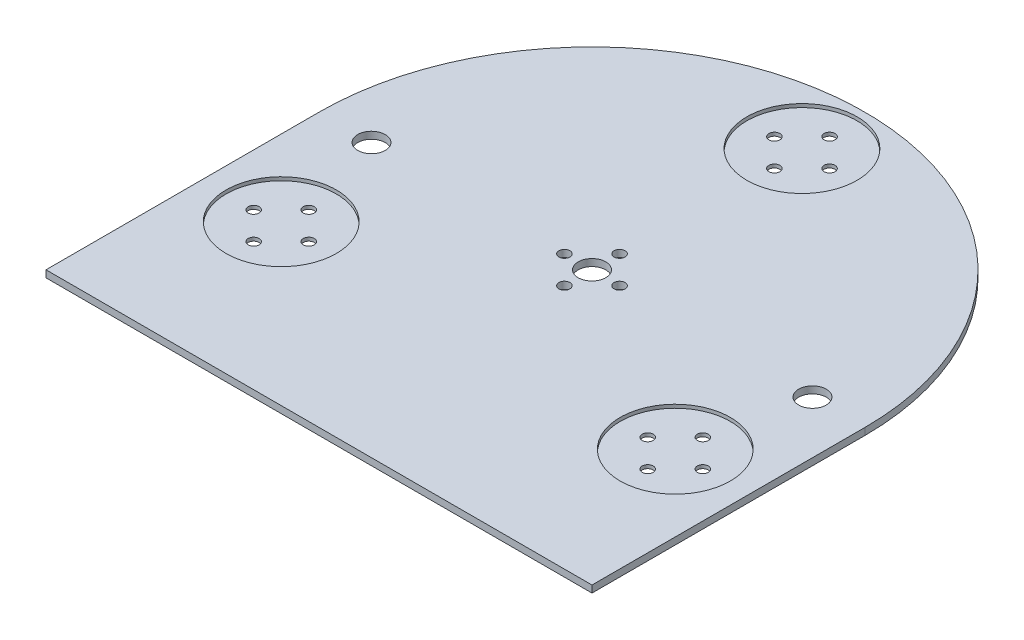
ISO-10303-21;
HEADER;
FILE_DESCRIPTION(('STEP AP214'),'2;1');
FILE_NAME('part.step','',(''),(''),'','','');
FILE_SCHEMA(('AUTOMOTIVE_DESIGN { 1 0 10303 214 1 1 1 1 }'));
ENDSEC;
DATA;
#1=APPLICATION_CONTEXT('core data for automotive mechanical design processes');
#2=APPLICATION_PROTOCOL_DEFINITION('international standard','automotive_design',2000,#1);
#3=PRODUCT_CONTEXT('',#1,'mechanical');
#4=PRODUCT('Part','Part','',(#3));
#5=PRODUCT_RELATED_PRODUCT_CATEGORY('part','',(#4));
#6=PRODUCT_DEFINITION_FORMATION('','',#4);
#7=PRODUCT_DEFINITION_CONTEXT('part definition',#1,'design');
#8=PRODUCT_DEFINITION('design','',#6,#7);
#9=PRODUCT_DEFINITION_SHAPE('','',#8);
#10=(LENGTH_UNIT() NAMED_UNIT(*) SI_UNIT(.MILLI.,.METRE.));
#11=(NAMED_UNIT(*) PLANE_ANGLE_UNIT() SI_UNIT($,.RADIAN.));
#12=(NAMED_UNIT(*) SI_UNIT($,.STERADIAN.) SOLID_ANGLE_UNIT());
#13=UNCERTAINTY_MEASURE_WITH_UNIT(LENGTH_MEASURE(1.E-05),#10,'distance_accuracy_value','');
#14=(GEOMETRIC_REPRESENTATION_CONTEXT(3) GLOBAL_UNCERTAINTY_ASSIGNED_CONTEXT((#13)) GLOBAL_UNIT_ASSIGNED_CONTEXT((#10,
#11,#12)) REPRESENTATION_CONTEXT('',''));
#15=CARTESIAN_POINT('',(0.,0.,0.));
#16=DIRECTION('',(0.,0.,1.));
#17=DIRECTION('',(1.,0.,0.));
#18=AXIS2_PLACEMENT_3D('',#15,#16,#17);
#19=CARTESIAN_POINT('',(0.,2.54,0.));
#20=DIRECTION('',(0.,-1.,0.));
#21=DIRECTION('',(0.,0.,-1.));
#22=AXIS2_PLACEMENT_3D('',#19,#20,#21);
#23=CYLINDRICAL_SURFACE('',#22,99.06);
#24=CARTESIAN_POINT('',(0.,0.,0.));
#25=DIRECTION('',(0.,1.,0.));
#26=DIRECTION('',(0.,0.,1.));
#27=AXIS2_PLACEMENT_3D('',#24,#25,#26);
#28=CIRCLE('',#27,99.06);
#29=CARTESIAN_POINT('',(99.06,0.,0.));
#30=VERTEX_POINT('',#29);
#31=CARTESIAN_POINT('',(-99.06,0.,0.));
#32=VERTEX_POINT('',#31);
#33=EDGE_CURVE('E122',#30,#32,#28,.T.);
#34=ORIENTED_EDGE('',*,*,#33,.T.);
#35=DIRECTION('',(0.,-1.,0.));
#36=VECTOR('',#35,1.);
#37=CARTESIAN_POINT('',(-99.06,2.54,0.));
#38=LINE('',#37,#36);
#39=CARTESIAN_POINT('',(-99.06,2.54,0.));
#40=VERTEX_POINT('',#39);
#41=EDGE_CURVE('E11',#40,#32,#38,.T.);
#42=ORIENTED_EDGE('',*,*,#41,.F.);
#43=CARTESIAN_POINT('',(0.,2.54,0.));
#44=DIRECTION('',(0.,1.,0.));
#45=DIRECTION('',(0.,0.,1.));
#46=AXIS2_PLACEMENT_3D('',#43,#44,#45);
#47=CIRCLE('',#46,99.06);
#48=CARTESIAN_POINT('',(99.06,2.54,0.));
#49=VERTEX_POINT('',#48);
#50=EDGE_CURVE('E103',#49,#40,#47,.T.);
#51=ORIENTED_EDGE('',*,*,#50,.F.);
#52=DIRECTION('',(0.,-1.,0.));
#53=VECTOR('',#52,1.);
#54=CARTESIAN_POINT('',(99.06,2.54,0.));
#55=LINE('',#54,#53);
#56=EDGE_CURVE('E70',#49,#30,#55,.T.);
#57=ORIENTED_EDGE('',*,*,#56,.T.);
#58=EDGE_LOOP('',(#34,#42,#51,#57));
#59=FACE_BOUND('',#58,.T.);
#60=ADVANCED_FACE('F51',(#59),#23,.T.);
#61=CARTESIAN_POINT('',(-99.06,2.54,0.));
#62=DIRECTION('',(1.,0.,0.));
#63=DIRECTION('',(0.,0.,-1.));
#64=AXIS2_PLACEMENT_3D('',#61,#62,#63);
#65=PLANE('',#64);
#66=DIRECTION('',(0.,0.,1.));
#67=VECTOR('',#66,1.);
#68=CARTESIAN_POINT('',(-99.06,0.,0.));
#69=LINE('',#68,#67);
#70=CARTESIAN_POINT('',(-99.06,0.,99.06));
#71=VERTEX_POINT('',#70);
#72=EDGE_CURVE('E109',#32,#71,#69,.T.);
#73=ORIENTED_EDGE('',*,*,#72,.T.);
#74=DIRECTION('',(0.,-1.,0.));
#75=VECTOR('',#74,1.);
#76=CARTESIAN_POINT('',(-99.06,2.54,99.06));
#77=LINE('',#76,#75);
#78=CARTESIAN_POINT('',(-99.06,2.54,99.06));
#79=VERTEX_POINT('',#78);
#80=EDGE_CURVE('E61',#79,#71,#77,.T.);
#81=ORIENTED_EDGE('',*,*,#80,.F.);
#82=DIRECTION('',(0.,0.,1.));
#83=VECTOR('',#82,1.);
#84=CARTESIAN_POINT('',(-99.06,2.54,0.));
#85=LINE('',#84,#83);
#86=EDGE_CURVE('E96',#40,#79,#85,.T.);
#87=ORIENTED_EDGE('',*,*,#86,.F.);
#88=ORIENTED_EDGE('',*,*,#41,.T.);
#89=EDGE_LOOP('',(#73,#81,#87,#88));
#90=FACE_BOUND('',#89,.T.);
#91=ADVANCED_FACE('F108',(#90),#65,.F.);
#92=CARTESIAN_POINT('',(0.,2.54,99.06));
#93=DIRECTION('',(0.,0.,-1.));
#94=DIRECTION('',(-1.,0.,0.));
#95=AXIS2_PLACEMENT_3D('',#92,#93,#94);
#96=PLANE('',#95);
#97=DIRECTION('',(1.,0.,0.));
#98=VECTOR('',#97,1.);
#99=CARTESIAN_POINT('',(0.,0.,99.06));
#100=LINE('',#99,#98);
#101=CARTESIAN_POINT('',(99.06,0.,99.06));
#102=VERTEX_POINT('',#101);
#103=EDGE_CURVE('E128',#71,#102,#100,.T.);
#104=ORIENTED_EDGE('',*,*,#103,.T.);
#105=DIRECTION('',(0.,-1.,0.));
#106=VECTOR('',#105,1.);
#107=CARTESIAN_POINT('',(99.06,2.54,99.06));
#108=LINE('',#107,#106);
#109=CARTESIAN_POINT('',(99.06,2.54,99.06));
#110=VERTEX_POINT('',#109);
#111=EDGE_CURVE('E85',#110,#102,#108,.T.);
#112=ORIENTED_EDGE('',*,*,#111,.F.);
#113=DIRECTION('',(1.,0.,0.));
#114=VECTOR('',#113,1.);
#115=CARTESIAN_POINT('',(0.,2.54,99.06));
#116=LINE('',#115,#114);
#117=EDGE_CURVE('E102',#79,#110,#116,.T.);
#118=ORIENTED_EDGE('',*,*,#117,.F.);
#119=ORIENTED_EDGE('',*,*,#80,.T.);
#120=EDGE_LOOP('',(#104,#112,#118,#119));
#121=FACE_BOUND('',#120,.T.);
#122=ADVANCED_FACE('F114',(#121),#96,.F.);
#123=CARTESIAN_POINT('',(99.06,2.54,0.));
#124=DIRECTION('',(1.,0.,0.));
#125=DIRECTION('',(0.,0.,-1.));
#126=AXIS2_PLACEMENT_3D('',#123,#124,#125);
#127=PLANE('',#126);
#128=DIRECTION('',(0.,0.,1.));
#129=VECTOR('',#128,1.);
#130=CARTESIAN_POINT('',(99.06,0.,0.));
#131=LINE('',#130,#129);
#132=EDGE_CURVE('E131',#30,#102,#131,.T.);
#133=ORIENTED_EDGE('',*,*,#132,.F.);
#134=ORIENTED_EDGE('',*,*,#56,.F.);
#135=DIRECTION('',(0.,0.,1.));
#136=VECTOR('',#135,1.);
#137=CARTESIAN_POINT('',(99.06,2.54,0.));
#138=LINE('',#137,#136);
#139=EDGE_CURVE('E116',#49,#110,#138,.T.);
#140=ORIENTED_EDGE('',*,*,#139,.T.);
#141=ORIENTED_EDGE('',*,*,#111,.T.);
#142=EDGE_LOOP('',(#133,#134,#140,#141));
#143=FACE_BOUND('',#142,.T.);
#144=ADVANCED_FACE('F230',(#143),#127,.T.);
#145=CARTESIAN_POINT('',(0.,2.54,0.));
#146=DIRECTION('',(0.,1.,0.));
#147=DIRECTION('',(0.,0.,1.));
#148=AXIS2_PLACEMENT_3D('',#145,#146,#147);
#149=PLANE('',#148);
#150=CARTESIAN_POINT('',(-10.,2.54,-1.04950770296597E-13));
#151=DIRECTION('',(0.,1.,0.));
#152=DIRECTION('',(0.,0.,1.));
#153=AXIS2_PLACEMENT_3D('',#150,#151,#152);
#154=CIRCLE('',#153,2.);
#155=CARTESIAN_POINT('',(-10.,2.54,1.99999999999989));
#156=VERTEX_POINT('',#155);
#157=EDGE_CURVE('E587',#156,#156,#154,.T.);
#158=ORIENTED_EDGE('',*,*,#157,.F.);
#159=EDGE_LOOP('',(#158));
#160=FACE_BOUND('',#159,.T.);
#161=CARTESIAN_POINT('',(0.,2.54,10.));
#162=DIRECTION('',(0.,1.,0.));
#163=DIRECTION('',(0.,0.,1.));
#164=AXIS2_PLACEMENT_3D('',#161,#162,#163);
#165=CIRCLE('',#164,2.);
#166=CARTESIAN_POINT('',(0.,2.54,12.));
#167=VERTEX_POINT('',#166);
#168=EDGE_CURVE('E594',#167,#167,#165,.T.);
#169=ORIENTED_EDGE('',*,*,#168,.F.);
#170=EDGE_LOOP('',(#169));
#171=FACE_BOUND('',#170,.T.);
#172=CARTESIAN_POINT('',(0.,2.54,-10.));
#173=DIRECTION('',(0.,1.,0.));
#174=DIRECTION('',(0.,0.,1.));
#175=AXIS2_PLACEMENT_3D('',#172,#173,#174);
#176=CIRCLE('',#175,2.);
#177=CARTESIAN_POINT('',(0.,2.54,-8.));
#178=VERTEX_POINT('',#177);
#179=EDGE_CURVE('E649',#178,#178,#176,.T.);
#180=ORIENTED_EDGE('',*,*,#179,.F.);
#181=EDGE_LOOP('',(#180));
#182=FACE_BOUND('',#181,.T.);
#183=CARTESIAN_POINT('',(10.,2.54,0.));
#184=DIRECTION('',(0.,1.,0.));
#185=DIRECTION('',(0.,0.,1.));
#186=AXIS2_PLACEMENT_3D('',#183,#184,#185);
#187=CIRCLE('',#186,2.);
#188=CARTESIAN_POINT('',(10.,2.54,2.00000000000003));
#189=VERTEX_POINT('',#188);
#190=EDGE_CURVE('E629',#189,#189,#187,.T.);
#191=ORIENTED_EDGE('',*,*,#190,.F.);
#192=EDGE_LOOP('',(#191));
#193=FACE_BOUND('',#192,.T.);
#194=CARTESIAN_POINT('',(0.,2.54,0.));
#195=DIRECTION('',(0.,1.,0.));
#196=DIRECTION('',(0.,0.,1.));
#197=AXIS2_PLACEMENT_3D('',#194,#195,#196);
#198=CIRCLE('',#197,5.);
#199=CARTESIAN_POINT('',(0.,2.54,5.));
#200=VERTEX_POINT('',#199);
#201=EDGE_CURVE('E686',#200,#200,#198,.T.);
#202=ORIENTED_EDGE('',*,*,#201,.F.);
#203=EDGE_LOOP('',(#202));
#204=FACE_BOUND('',#203,.T.);
#205=CARTESIAN_POINT('',(-80.01,2.54,0.));
#206=DIRECTION('',(0.,1.,0.));
#207=DIRECTION('',(0.,0.,1.));
#208=AXIS2_PLACEMENT_3D('',#205,#206,#207);
#209=CIRCLE('',#208,5.);
#210=CARTESIAN_POINT('',(-80.01,2.54,5.00000000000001));
#211=VERTEX_POINT('',#210);
#212=EDGE_CURVE('E191',#211,#211,#209,.T.);
#213=ORIENTED_EDGE('',*,*,#212,.F.);
#214=EDGE_LOOP('',(#213));
#215=FACE_BOUND('',#214,.T.);
#216=CARTESIAN_POINT('',(0.,2.54,-76.2));
#217=DIRECTION('',(0.,1.,0.));
#218=DIRECTION('',(0.,0.,1.));
#219=AXIS2_PLACEMENT_3D('',#216,#217,#218);
#220=CIRCLE('',#219,20.);
#221=CARTESIAN_POINT('',(0.,2.54,-56.2));
#222=VERTEX_POINT('',#221);
#223=EDGE_CURVE('E211',#222,#222,#220,.T.);
#224=ORIENTED_EDGE('',*,*,#223,.F.);
#225=EDGE_LOOP('',(#224));
#226=FACE_BOUND('',#225,.T.);
#227=CARTESIAN_POINT('',(71.4903970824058,2.54,41.2749999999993));
#228=DIRECTION('',(0.,1.,0.));
#229=DIRECTION('',(0.,0.,1.));
#230=AXIS2_PLACEMENT_3D('',#227,#228,#229);
#231=CIRCLE('',#230,20.);
#232=CARTESIAN_POINT('',(71.4903970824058,2.54,61.2749999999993));
#233=VERTEX_POINT('',#232);
#234=EDGE_CURVE('E202',#233,#233,#231,.T.);
#235=ORIENTED_EDGE('',*,*,#234,.F.);
#236=EDGE_LOOP('',(#235));
#237=FACE_BOUND('',#236,.T.);
#238=CARTESIAN_POINT('',(80.01,2.54,0.));
#239=DIRECTION('',(0.,1.,0.));
#240=DIRECTION('',(0.,0.,-1.));
#241=AXIS2_PLACEMENT_3D('',#238,#239,#240);
#242=CIRCLE('',#241,5.00000000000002);
#243=CARTESIAN_POINT('',(80.01,2.54,-5.00000000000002));
#244=VERTEX_POINT('',#243);
#245=EDGE_CURVE('E186',#244,#244,#242,.T.);
#246=ORIENTED_EDGE('',*,*,#245,.F.);
#247=EDGE_LOOP('',(#246));
#248=FACE_BOUND('',#247,.T.);
#249=CARTESIAN_POINT('',(-71.4903970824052,2.54,41.2750000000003));
#250=DIRECTION('',(0.,1.,0.));
#251=DIRECTION('',(0.,0.,1.));
#252=AXIS2_PLACEMENT_3D('',#249,#250,#251);
#253=CIRCLE('',#252,20.);
#254=CARTESIAN_POINT('',(-71.4903970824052,2.54,61.2750000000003));
#255=VERTEX_POINT('',#254);
#256=EDGE_CURVE('E206',#255,#255,#253,.T.);
#257=ORIENTED_EDGE('',*,*,#256,.F.);
#258=EDGE_LOOP('',(#257));
#259=FACE_BOUND('',#258,.T.);
#260=ORIENTED_EDGE('',*,*,#50,.T.);
#261=ORIENTED_EDGE('',*,*,#86,.T.);
#262=ORIENTED_EDGE('',*,*,#117,.T.);
#263=ORIENTED_EDGE('',*,*,#139,.F.);
#264=EDGE_LOOP('',(#260,#261,#262,#263));
#265=FACE_BOUND('',#264,.T.);
#266=ADVANCED_FACE('F99',(#160,#171,#182,#193,#204,#215,#226,#237,#248,#259,#265),#149,.T.);
#267=CARTESIAN_POINT('',(0.,0.,0.));
#268=DIRECTION('',(0.,1.,0.));
#269=DIRECTION('',(0.,0.,1.));
#270=AXIS2_PLACEMENT_3D('',#267,#268,#269);
#271=PLANE('',#270);
#272=CARTESIAN_POINT('',(9.99999999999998,0.,-76.1999999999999));
#273=DIRECTION('',(0.,1.,0.));
#274=DIRECTION('',(0.,0.,1.));
#275=AXIS2_PLACEMENT_3D('',#272,#273,#274);
#276=CIRCLE('',#275,2.00000000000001);
#277=CARTESIAN_POINT('',(9.99999999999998,0.,-74.1999999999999));
#278=VERTEX_POINT('',#277);
#279=EDGE_CURVE('E607',#278,#278,#276,.T.);
#280=ORIENTED_EDGE('',*,*,#279,.T.);
#281=EDGE_LOOP('',(#280));
#282=FACE_BOUND('',#281,.T.);
#283=CARTESIAN_POINT('',(81.4903970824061,0.,41.274999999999));
#284=DIRECTION('',(0.,1.,0.));
#285=DIRECTION('',(0.,0.,1.));
#286=AXIS2_PLACEMENT_3D('',#283,#284,#285);
#287=CIRCLE('',#286,2.);
#288=CARTESIAN_POINT('',(81.4903970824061,0.,43.274999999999));
#289=VERTEX_POINT('',#288);
#290=EDGE_CURVE('E612',#289,#289,#287,.T.);
#291=ORIENTED_EDGE('',*,*,#290,.T.);
#292=EDGE_LOOP('',(#291));
#293=FACE_BOUND('',#292,.T.);
#294=CARTESIAN_POINT('',(71.4903970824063,0.,51.2749999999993));
#295=DIRECTION('',(0.,1.,0.));
#296=DIRECTION('',(0.,0.,1.));
#297=AXIS2_PLACEMENT_3D('',#294,#295,#296);
#298=CIRCLE('',#297,2.);
#299=CARTESIAN_POINT('',(71.4903970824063,0.,53.2749999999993));
#300=VERTEX_POINT('',#299);
#301=EDGE_CURVE('E608',#300,#300,#298,.T.);
#302=ORIENTED_EDGE('',*,*,#301,.T.);
#303=EDGE_LOOP('',(#302));
#304=FACE_BOUND('',#303,.T.);
#305=CARTESIAN_POINT('',(61.4903970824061,0.,41.2749999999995));
#306=DIRECTION('',(0.,1.,0.));
#307=DIRECTION('',(0.,0.,1.));
#308=AXIS2_PLACEMENT_3D('',#305,#306,#307);
#309=CIRCLE('',#308,2.);
#310=CARTESIAN_POINT('',(61.4903970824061,0.,43.2749999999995));
#311=VERTEX_POINT('',#310);
#312=EDGE_CURVE('E613',#311,#311,#309,.T.);
#313=ORIENTED_EDGE('',*,*,#312,.T.);
#314=EDGE_LOOP('',(#313));
#315=FACE_BOUND('',#314,.T.);
#316=CARTESIAN_POINT('',(0.,0.,-86.2));
#317=DIRECTION('',(0.,1.,0.));
#318=DIRECTION('',(0.,0.,1.));
#319=AXIS2_PLACEMENT_3D('',#316,#317,#318);
#320=CIRCLE('',#319,2.);
#321=CARTESIAN_POINT('',(0.,0.,-84.2));
#322=VERTEX_POINT('',#321);
#323=EDGE_CURVE('E603',#322,#322,#320,.T.);
#324=ORIENTED_EDGE('',*,*,#323,.T.);
#325=EDGE_LOOP('',(#324));
#326=FACE_BOUND('',#325,.T.);
#327=CARTESIAN_POINT('',(-10.,0.,-76.2));
#328=DIRECTION('',(0.,1.,0.));
#329=DIRECTION('',(0.,0.,1.));
#330=AXIS2_PLACEMENT_3D('',#327,#328,#329);
#331=CIRCLE('',#330,2.);
#332=CARTESIAN_POINT('',(-10.,0.,-74.2));
#333=VERTEX_POINT('',#332);
#334=EDGE_CURVE('E596',#333,#333,#331,.T.);
#335=ORIENTED_EDGE('',*,*,#334,.T.);
#336=EDGE_LOOP('',(#335));
#337=FACE_BOUND('',#336,.T.);
#338=CARTESIAN_POINT('',(-10.,0.,-1.04950770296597E-13));
#339=DIRECTION('',(0.,1.,0.));
#340=DIRECTION('',(0.,0.,1.));
#341=AXIS2_PLACEMENT_3D('',#338,#339,#340);
#342=CIRCLE('',#341,2.);
#343=CARTESIAN_POINT('',(-10.,0.,1.99999999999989));
#344=VERTEX_POINT('',#343);
#345=EDGE_CURVE('E585',#344,#344,#342,.T.);
#346=ORIENTED_EDGE('',*,*,#345,.T.);
#347=EDGE_LOOP('',(#346));
#348=FACE_BOUND('',#347,.T.);
#349=CARTESIAN_POINT('',(0.,0.,10.));
#350=DIRECTION('',(0.,1.,0.));
#351=DIRECTION('',(0.,0.,1.));
#352=AXIS2_PLACEMENT_3D('',#349,#350,#351);
#353=CIRCLE('',#352,2.);
#354=CARTESIAN_POINT('',(0.,0.,12.));
#355=VERTEX_POINT('',#354);
#356=EDGE_CURVE('E589',#355,#355,#353,.T.);
#357=ORIENTED_EDGE('',*,*,#356,.T.);
#358=EDGE_LOOP('',(#357));
#359=FACE_BOUND('',#358,.T.);
#360=CARTESIAN_POINT('',(0.,0.,-10.));
#361=DIRECTION('',(0.,1.,0.));
#362=DIRECTION('',(0.,0.,1.));
#363=AXIS2_PLACEMENT_3D('',#360,#361,#362);
#364=CIRCLE('',#363,2.);
#365=CARTESIAN_POINT('',(0.,0.,-8.));
#366=VERTEX_POINT('',#365);
#367=EDGE_CURVE('E645',#366,#366,#364,.T.);
#368=ORIENTED_EDGE('',*,*,#367,.T.);
#369=EDGE_LOOP('',(#368));
#370=FACE_BOUND('',#369,.T.);
#371=CARTESIAN_POINT('',(0.,0.,-66.2));
#372=DIRECTION('',(0.,1.,0.));
#373=DIRECTION('',(0.,0.,1.));
#374=AXIS2_PLACEMENT_3D('',#371,#372,#373);
#375=CIRCLE('',#374,2.);
#376=CARTESIAN_POINT('',(0.,0.,-64.2));
#377=VERTEX_POINT('',#376);
#378=EDGE_CURVE('E650',#377,#377,#375,.T.);
#379=ORIENTED_EDGE('',*,*,#378,.T.);
#380=EDGE_LOOP('',(#379));
#381=FACE_BOUND('',#380,.T.);
#382=CARTESIAN_POINT('',(71.4903970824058,0.,31.2749999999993));
#383=DIRECTION('',(0.,1.,0.));
#384=DIRECTION('',(0.,0.,1.));
#385=AXIS2_PLACEMENT_3D('',#382,#383,#384);
#386=CIRCLE('',#385,2.);
#387=CARTESIAN_POINT('',(71.4903970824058,0.,33.2749999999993));
#388=VERTEX_POINT('',#387);
#389=EDGE_CURVE('E657',#388,#388,#386,.T.);
#390=ORIENTED_EDGE('',*,*,#389,.T.);
#391=EDGE_LOOP('',(#390));
#392=FACE_BOUND('',#391,.T.);
#393=CARTESIAN_POINT('',(-80.01,0.,0.));
#394=DIRECTION('',(0.,1.,0.));
#395=DIRECTION('',(0.,0.,1.));
#396=AXIS2_PLACEMENT_3D('',#393,#394,#395);
#397=CIRCLE('',#396,5.);
#398=CARTESIAN_POINT('',(-80.01,0.,5.00000000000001));
#399=VERTEX_POINT('',#398);
#400=EDGE_CURVE('E641',#399,#399,#397,.T.);
#401=ORIENTED_EDGE('',*,*,#400,.T.);
#402=EDGE_LOOP('',(#401));
#403=FACE_BOUND('',#402,.T.);
#404=CARTESIAN_POINT('',(10.,0.,0.));
#405=DIRECTION('',(0.,1.,0.));
#406=DIRECTION('',(0.,0.,1.));
#407=AXIS2_PLACEMENT_3D('',#404,#405,#406);
#408=CIRCLE('',#407,2.);
#409=CARTESIAN_POINT('',(10.,0.,2.00000000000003));
#410=VERTEX_POINT('',#409);
#411=EDGE_CURVE('E630',#410,#410,#408,.T.);
#412=ORIENTED_EDGE('',*,*,#411,.T.);
#413=EDGE_LOOP('',(#412));
#414=FACE_BOUND('',#413,.T.);
#415=CARTESIAN_POINT('',(-81.4903970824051,0.,41.2750000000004));
#416=DIRECTION('',(0.,1.,0.));
#417=DIRECTION('',(0.,0.,1.));
#418=AXIS2_PLACEMENT_3D('',#415,#416,#417);
#419=CIRCLE('',#418,2.);
#420=CARTESIAN_POINT('',(-81.4903970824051,0.,43.2750000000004));
#421=VERTEX_POINT('',#420);
#422=EDGE_CURVE('E624',#421,#421,#419,.T.);
#423=ORIENTED_EDGE('',*,*,#422,.T.);
#424=EDGE_LOOP('',(#423));
#425=FACE_BOUND('',#424,.T.);
#426=CARTESIAN_POINT('',(-71.490397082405,0.,51.2750000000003));
#427=DIRECTION('',(0.,1.,0.));
#428=DIRECTION('',(0.,0.,1.));
#429=AXIS2_PLACEMENT_3D('',#426,#427,#428);
#430=CIRCLE('',#429,2.);
#431=CARTESIAN_POINT('',(-71.490397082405,0.,53.2750000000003));
#432=VERTEX_POINT('',#431);
#433=EDGE_CURVE('E628',#432,#432,#430,.T.);
#434=ORIENTED_EDGE('',*,*,#433,.T.);
#435=EDGE_LOOP('',(#434));
#436=FACE_BOUND('',#435,.T.);
#437=CARTESIAN_POINT('',(-61.4903970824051,0.,41.2750000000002));
#438=DIRECTION('',(0.,1.,0.));
#439=DIRECTION('',(0.,0.,1.));
#440=AXIS2_PLACEMENT_3D('',#437,#438,#439);
#441=CIRCLE('',#440,2.);
#442=CARTESIAN_POINT('',(-61.4903970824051,0.,43.2750000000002));
#443=VERTEX_POINT('',#442);
#444=EDGE_CURVE('E637',#443,#443,#441,.T.);
#445=ORIENTED_EDGE('',*,*,#444,.T.);
#446=EDGE_LOOP('',(#445));
#447=FACE_BOUND('',#446,.T.);
#448=CARTESIAN_POINT('',(80.01,0.,0.));
#449=DIRECTION('',(0.,1.,0.));
#450=DIRECTION('',(0.,0.,1.));
#451=AXIS2_PLACEMENT_3D('',#448,#449,#450);
#452=CIRCLE('',#451,5.);
#453=CARTESIAN_POINT('',(80.01,0.,5.));
#454=VERTEX_POINT('',#453);
#455=EDGE_CURVE('E617',#454,#454,#452,.T.);
#456=ORIENTED_EDGE('',*,*,#455,.T.);
#457=EDGE_LOOP('',(#456));
#458=FACE_BOUND('',#457,.T.);
#459=CARTESIAN_POINT('',(0.,0.,0.));
#460=DIRECTION('',(0.,1.,0.));
#461=DIRECTION('',(0.,0.,1.));
#462=AXIS2_PLACEMENT_3D('',#459,#460,#461);
#463=CIRCLE('',#462,5.);
#464=CARTESIAN_POINT('',(0.,0.,5.));
#465=VERTEX_POINT('',#464);
#466=EDGE_CURVE('E680',#465,#465,#463,.T.);
#467=ORIENTED_EDGE('',*,*,#466,.T.);
#468=EDGE_LOOP('',(#467));
#469=FACE_BOUND('',#468,.T.);
#470=CARTESIAN_POINT('',(-71.4903970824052,0.,31.2750000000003));
#471=DIRECTION('',(0.,1.,0.));
#472=DIRECTION('',(0.,0.,1.));
#473=AXIS2_PLACEMENT_3D('',#470,#471,#472);
#474=CIRCLE('',#473,2.);
#475=CARTESIAN_POINT('',(-71.4903970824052,0.,33.2750000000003));
#476=VERTEX_POINT('',#475);
#477=EDGE_CURVE('E144',#476,#476,#474,.T.);
#478=ORIENTED_EDGE('',*,*,#477,.T.);
#479=EDGE_LOOP('',(#478));
#480=FACE_BOUND('',#479,.T.);
#481=ORIENTED_EDGE('',*,*,#33,.F.);
#482=ORIENTED_EDGE('',*,*,#132,.T.);
#483=ORIENTED_EDGE('',*,*,#103,.F.);
#484=ORIENTED_EDGE('',*,*,#72,.F.);
#485=EDGE_LOOP('',(#481,#482,#483,#484));
#486=FACE_BOUND('',#485,.T.);
#487=ADVANCED_FACE('F229',(#282,#293,#304,#315,#326,#337,#348,#359,#370,#381,#392,#403,#414,
#425,#436,#447,#458,#469,#480,#486),#271,.F.);
#488=CARTESIAN_POINT('',(-71.4903970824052,1.27,41.2750000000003));
#489=DIRECTION('',(0.,1.,0.));
#490=DIRECTION('',(0.,0.,1.));
#491=AXIS2_PLACEMENT_3D('',#488,#489,#490);
#492=CYLINDRICAL_SURFACE('',#491,20.);
#493=CARTESIAN_POINT('',(-71.4903970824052,1.27,41.2750000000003));
#494=DIRECTION('',(0.,1.,0.));
#495=DIRECTION('',(0.,0.,1.));
#496=AXIS2_PLACEMENT_3D('',#493,#494,#495);
#497=CIRCLE('',#496,20.);
#498=CARTESIAN_POINT('',(-71.4903970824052,1.27,61.2750000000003));
#499=VERTEX_POINT('',#498);
#500=EDGE_CURVE('E125',#499,#499,#497,.T.);
#501=ORIENTED_EDGE('',*,*,#500,.F.);
#502=EDGE_LOOP('',(#501));
#503=FACE_BOUND('',#502,.T.);
#504=ORIENTED_EDGE('',*,*,#256,.T.);
#505=EDGE_LOOP('',(#504));
#506=FACE_BOUND('',#505,.T.);
#507=ADVANCED_FACE('F226',(#503,#506),#492,.F.);
#508=CARTESIAN_POINT('',(-71.4903970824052,1.27,41.2750000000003));
#509=DIRECTION('',(0.,1.,0.));
#510=DIRECTION('',(0.,0.,1.));
#511=AXIS2_PLACEMENT_3D('',#508,#509,#510);
#512=PLANE('',#511);
#513=CARTESIAN_POINT('',(-81.4903970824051,1.27,41.2750000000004));
#514=DIRECTION('',(0.,1.,0.));
#515=DIRECTION('',(0.,0.,1.));
#516=AXIS2_PLACEMENT_3D('',#513,#514,#515);
#517=CIRCLE('',#516,2.);
#518=CARTESIAN_POINT('',(-81.4903970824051,1.27,43.2750000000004));
#519=VERTEX_POINT('',#518);
#520=EDGE_CURVE('E54',#519,#519,#517,.T.);
#521=ORIENTED_EDGE('',*,*,#520,.F.);
#522=EDGE_LOOP('',(#521));
#523=FACE_BOUND('',#522,.T.);
#524=CARTESIAN_POINT('',(-71.490397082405,1.27,51.2750000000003));
#525=DIRECTION('',(0.,1.,0.));
#526=DIRECTION('',(0.,0.,1.));
#527=AXIS2_PLACEMENT_3D('',#524,#525,#526);
#528=CIRCLE('',#527,2.);
#529=CARTESIAN_POINT('',(-71.490397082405,1.27,53.2750000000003));
#530=VERTEX_POINT('',#529);
#531=EDGE_CURVE('E179',#530,#530,#528,.T.);
#532=ORIENTED_EDGE('',*,*,#531,.F.);
#533=EDGE_LOOP('',(#532));
#534=FACE_BOUND('',#533,.T.);
#535=CARTESIAN_POINT('',(-61.4903970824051,1.27,41.2750000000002));
#536=DIRECTION('',(0.,1.,0.));
#537=DIRECTION('',(0.,0.,1.));
#538=AXIS2_PLACEMENT_3D('',#535,#536,#537);
#539=CIRCLE('',#538,2.);
#540=CARTESIAN_POINT('',(-61.4903970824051,1.27,43.2750000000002));
#541=VERTEX_POINT('',#540);
#542=EDGE_CURVE('E176',#541,#541,#539,.T.);
#543=ORIENTED_EDGE('',*,*,#542,.F.);
#544=EDGE_LOOP('',(#543));
#545=FACE_BOUND('',#544,.T.);
#546=CARTESIAN_POINT('',(-71.4903970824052,1.27,31.2750000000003));
#547=DIRECTION('',(0.,1.,0.));
#548=DIRECTION('',(0.,0.,1.));
#549=AXIS2_PLACEMENT_3D('',#546,#547,#548);
#550=CIRCLE('',#549,2.);
#551=CARTESIAN_POINT('',(-71.4903970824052,1.27,33.2750000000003));
#552=VERTEX_POINT('',#551);
#553=EDGE_CURVE('E172',#552,#552,#550,.T.);
#554=ORIENTED_EDGE('',*,*,#553,.F.);
#555=EDGE_LOOP('',(#554));
#556=FACE_BOUND('',#555,.T.);
#557=ORIENTED_EDGE('',*,*,#500,.T.);
#558=EDGE_LOOP('',(#557));
#559=FACE_BOUND('',#558,.T.);
#560=ADVANCED_FACE('F272',(#523,#534,#545,#556,#559),#512,.T.);
#561=CARTESIAN_POINT('',(80.01,1.27,0.));
#562=DIRECTION('',(0.,1.,0.));
#563=DIRECTION('',(0.,0.,1.));
#564=AXIS2_PLACEMENT_3D('',#561,#562,#563);
#565=CYLINDRICAL_SURFACE('',#564,5.00000000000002);
#566=ORIENTED_EDGE('',*,*,#245,.T.);
#567=EDGE_LOOP('',(#566));
#568=FACE_BOUND('',#567,.T.);
#569=ORIENTED_EDGE('',*,*,#455,.F.);
#570=EDGE_LOOP('',(#569));
#571=FACE_BOUND('',#570,.T.);
#572=ADVANCED_FACE('F276',(#568,#571),#565,.F.);
#573=CARTESIAN_POINT('',(71.4903970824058,1.27,41.2749999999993));
#574=DIRECTION('',(0.,1.,0.));
#575=DIRECTION('',(0.,0.,1.));
#576=AXIS2_PLACEMENT_3D('',#573,#574,#575);
#577=CYLINDRICAL_SURFACE('',#576,20.);
#578=CARTESIAN_POINT('',(71.4903970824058,1.27,41.2749999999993));
#579=DIRECTION('',(0.,1.,0.));
#580=DIRECTION('',(0.,0.,1.));
#581=AXIS2_PLACEMENT_3D('',#578,#579,#580);
#582=CIRCLE('',#581,20.);
#583=CARTESIAN_POINT('',(71.4903970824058,1.27,61.2749999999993));
#584=VERTEX_POINT('',#583);
#585=EDGE_CURVE('E207',#584,#584,#582,.T.);
#586=ORIENTED_EDGE('',*,*,#585,.F.);
#587=EDGE_LOOP('',(#586));
#588=FACE_BOUND('',#587,.T.);
#589=ORIENTED_EDGE('',*,*,#234,.T.);
#590=EDGE_LOOP('',(#589));
#591=FACE_BOUND('',#590,.T.);
#592=ADVANCED_FACE('F287',(#588,#591),#577,.F.);
#593=CARTESIAN_POINT('',(71.4903970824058,1.27,41.2749999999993));
#594=DIRECTION('',(0.,1.,0.));
#595=DIRECTION('',(0.,0.,1.));
#596=AXIS2_PLACEMENT_3D('',#593,#594,#595);
#597=PLANE('',#596);
#598=CARTESIAN_POINT('',(81.4903970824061,1.27,41.274999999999));
#599=DIRECTION('',(0.,1.,0.));
#600=DIRECTION('',(0.,0.,1.));
#601=AXIS2_PLACEMENT_3D('',#598,#599,#600);
#602=CIRCLE('',#601,2.);
#603=CARTESIAN_POINT('',(81.4903970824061,1.27,43.274999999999));
#604=VERTEX_POINT('',#603);
#605=EDGE_CURVE('E168',#604,#604,#602,.T.);
#606=ORIENTED_EDGE('',*,*,#605,.F.);
#607=EDGE_LOOP('',(#606));
#608=FACE_BOUND('',#607,.T.);
#609=CARTESIAN_POINT('',(71.4903970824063,1.27,51.2749999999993));
#610=DIRECTION('',(0.,1.,0.));
#611=DIRECTION('',(0.,0.,1.));
#612=AXIS2_PLACEMENT_3D('',#609,#610,#611);
#613=CIRCLE('',#612,2.);
#614=CARTESIAN_POINT('',(71.4903970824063,1.27,53.2749999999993));
#615=VERTEX_POINT('',#614);
#616=EDGE_CURVE('E164',#615,#615,#613,.T.);
#617=ORIENTED_EDGE('',*,*,#616,.F.);
#618=EDGE_LOOP('',(#617));
#619=FACE_BOUND('',#618,.T.);
#620=CARTESIAN_POINT('',(61.4903970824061,1.27,41.2749999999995));
#621=DIRECTION('',(0.,1.,0.));
#622=DIRECTION('',(0.,0.,1.));
#623=AXIS2_PLACEMENT_3D('',#620,#621,#622);
#624=CIRCLE('',#623,2.);
#625=CARTESIAN_POINT('',(61.4903970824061,1.27,43.2749999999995));
#626=VERTEX_POINT('',#625);
#627=EDGE_CURVE('E160',#626,#626,#624,.T.);
#628=ORIENTED_EDGE('',*,*,#627,.F.);
#629=EDGE_LOOP('',(#628));
#630=FACE_BOUND('',#629,.T.);
#631=CARTESIAN_POINT('',(71.4903970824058,1.27,31.2749999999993));
#632=DIRECTION('',(0.,1.,0.));
#633=DIRECTION('',(0.,0.,1.));
#634=AXIS2_PLACEMENT_3D('',#631,#632,#633);
#635=CIRCLE('',#634,2.);
#636=CARTESIAN_POINT('',(71.4903970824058,1.27,33.2749999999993));
#637=VERTEX_POINT('',#636);
#638=EDGE_CURVE('E156',#637,#637,#635,.T.);
#639=ORIENTED_EDGE('',*,*,#638,.F.);
#640=EDGE_LOOP('',(#639));
#641=FACE_BOUND('',#640,.T.);
#642=ORIENTED_EDGE('',*,*,#585,.T.);
#643=EDGE_LOOP('',(#642));
#644=FACE_BOUND('',#643,.T.);
#645=ADVANCED_FACE('F293',(#608,#619,#630,#641,#644),#597,.T.);
#646=CARTESIAN_POINT('',(0.,1.27,-76.2));
#647=DIRECTION('',(0.,1.,0.));
#648=DIRECTION('',(0.,0.,1.));
#649=AXIS2_PLACEMENT_3D('',#646,#647,#648);
#650=CYLINDRICAL_SURFACE('',#649,20.);
#651=CARTESIAN_POINT('',(0.,1.27,-76.2));
#652=DIRECTION('',(0.,1.,0.));
#653=DIRECTION('',(0.,0.,1.));
#654=AXIS2_PLACEMENT_3D('',#651,#652,#653);
#655=CIRCLE('',#654,20.);
#656=CARTESIAN_POINT('',(0.,1.27,-56.2));
#657=VERTEX_POINT('',#656);
#658=EDGE_CURVE('E197',#657,#657,#655,.T.);
#659=ORIENTED_EDGE('',*,*,#658,.F.);
#660=EDGE_LOOP('',(#659));
#661=FACE_BOUND('',#660,.T.);
#662=ORIENTED_EDGE('',*,*,#223,.T.);
#663=EDGE_LOOP('',(#662));
#664=FACE_BOUND('',#663,.T.);
#665=ADVANCED_FACE('F297',(#661,#664),#650,.F.);
#666=CARTESIAN_POINT('',(0.,1.27,-76.2));
#667=DIRECTION('',(0.,1.,0.));
#668=DIRECTION('',(0.,0.,1.));
#669=AXIS2_PLACEMENT_3D('',#666,#667,#668);
#670=PLANE('',#669);
#671=CARTESIAN_POINT('',(9.99999999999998,1.27,-76.1999999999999));
#672=DIRECTION('',(0.,1.,0.));
#673=DIRECTION('',(0.,0.,1.));
#674=AXIS2_PLACEMENT_3D('',#671,#672,#673);
#675=CIRCLE('',#674,2.00000000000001);
#676=CARTESIAN_POINT('',(9.99999999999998,1.27,-74.1999999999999));
#677=VERTEX_POINT('',#676);
#678=EDGE_CURVE('E152',#677,#677,#675,.T.);
#679=ORIENTED_EDGE('',*,*,#678,.F.);
#680=EDGE_LOOP('',(#679));
#681=FACE_BOUND('',#680,.T.);
#682=CARTESIAN_POINT('',(0.,1.27,-86.2));
#683=DIRECTION('',(0.,1.,0.));
#684=DIRECTION('',(0.,0.,1.));
#685=AXIS2_PLACEMENT_3D('',#682,#683,#684);
#686=CIRCLE('',#685,2.);
#687=CARTESIAN_POINT('',(0.,1.27,-84.2));
#688=VERTEX_POINT('',#687);
#689=EDGE_CURVE('E148',#688,#688,#686,.T.);
#690=ORIENTED_EDGE('',*,*,#689,.F.);
#691=EDGE_LOOP('',(#690));
#692=FACE_BOUND('',#691,.T.);
#693=CARTESIAN_POINT('',(-10.,1.27,-76.2));
#694=DIRECTION('',(0.,1.,0.));
#695=DIRECTION('',(0.,0.,1.));
#696=AXIS2_PLACEMENT_3D('',#693,#694,#695);
#697=CIRCLE('',#696,2.);
#698=CARTESIAN_POINT('',(-10.,1.27,-74.2));
#699=VERTEX_POINT('',#698);
#700=EDGE_CURVE('E143',#699,#699,#697,.T.);
#701=ORIENTED_EDGE('',*,*,#700,.F.);
#702=EDGE_LOOP('',(#701));
#703=FACE_BOUND('',#702,.T.);
#704=CARTESIAN_POINT('',(0.,1.27,-66.2));
#705=DIRECTION('',(0.,1.,0.));
#706=DIRECTION('',(0.,0.,1.));
#707=AXIS2_PLACEMENT_3D('',#704,#705,#706);
#708=CIRCLE('',#707,2.);
#709=CARTESIAN_POINT('',(0.,1.27,-64.2));
#710=VERTEX_POINT('',#709);
#711=EDGE_CURVE('E139',#710,#710,#708,.T.);
#712=ORIENTED_EDGE('',*,*,#711,.F.);
#713=EDGE_LOOP('',(#712));
#714=FACE_BOUND('',#713,.T.);
#715=ORIENTED_EDGE('',*,*,#658,.T.);
#716=EDGE_LOOP('',(#715));
#717=FACE_BOUND('',#716,.T.);
#718=ADVANCED_FACE('F305',(#681,#692,#703,#714,#717),#670,.T.);
#719=CARTESIAN_POINT('',(-80.01,1.27,0.));
#720=DIRECTION('',(0.,1.,0.));
#721=DIRECTION('',(0.,0.,1.));
#722=AXIS2_PLACEMENT_3D('',#719,#720,#721);
#723=CYLINDRICAL_SURFACE('',#722,5.);
#724=ORIENTED_EDGE('',*,*,#212,.T.);
#725=EDGE_LOOP('',(#724));
#726=FACE_BOUND('',#725,.T.);
#727=ORIENTED_EDGE('',*,*,#400,.F.);
#728=EDGE_LOOP('',(#727));
#729=FACE_BOUND('',#728,.T.);
#730=ADVANCED_FACE('F309',(#726,#729),#723,.F.);
#731=CARTESIAN_POINT('',(0.,0.,-66.2));
#732=DIRECTION('',(0.,1.,0.));
#733=DIRECTION('',(0.,0.,1.));
#734=AXIS2_PLACEMENT_3D('',#731,#732,#733);
#735=CYLINDRICAL_SURFACE('',#734,2.);
#736=ORIENTED_EDGE('',*,*,#711,.T.);
#737=EDGE_LOOP('',(#736));
#738=FACE_BOUND('',#737,.T.);
#739=ORIENTED_EDGE('',*,*,#378,.F.);
#740=EDGE_LOOP('',(#739));
#741=FACE_BOUND('',#740,.T.);
#742=ADVANCED_FACE('F317',(#738,#741),#735,.F.);
#743=CARTESIAN_POINT('',(-10.,0.,-76.2));
#744=DIRECTION('',(0.,1.,0.));
#745=DIRECTION('',(0.,0.,1.));
#746=AXIS2_PLACEMENT_3D('',#743,#744,#745);
#747=CYLINDRICAL_SURFACE('',#746,2.);
#748=ORIENTED_EDGE('',*,*,#700,.T.);
#749=EDGE_LOOP('',(#748));
#750=FACE_BOUND('',#749,.T.);
#751=ORIENTED_EDGE('',*,*,#334,.F.);
#752=EDGE_LOOP('',(#751));
#753=FACE_BOUND('',#752,.T.);
#754=ADVANCED_FACE('F325',(#750,#753),#747,.F.);
#755=CARTESIAN_POINT('',(0.,0.,-86.2));
#756=DIRECTION('',(0.,1.,0.));
#757=DIRECTION('',(0.,0.,1.));
#758=AXIS2_PLACEMENT_3D('',#755,#756,#757);
#759=CYLINDRICAL_SURFACE('',#758,2.);
#760=ORIENTED_EDGE('',*,*,#689,.T.);
#761=EDGE_LOOP('',(#760));
#762=FACE_BOUND('',#761,.T.);
#763=ORIENTED_EDGE('',*,*,#323,.F.);
#764=EDGE_LOOP('',(#763));
#765=FACE_BOUND('',#764,.T.);
#766=ADVANCED_FACE('F334',(#762,#765),#759,.F.);
#767=CARTESIAN_POINT('',(9.99999999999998,0.,-76.1999999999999));
#768=DIRECTION('',(0.,1.,0.));
#769=DIRECTION('',(0.,0.,1.));
#770=AXIS2_PLACEMENT_3D('',#767,#768,#769);
#771=CYLINDRICAL_SURFACE('',#770,2.00000000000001);
#772=ORIENTED_EDGE('',*,*,#678,.T.);
#773=EDGE_LOOP('',(#772));
#774=FACE_BOUND('',#773,.T.);
#775=ORIENTED_EDGE('',*,*,#279,.F.);
#776=EDGE_LOOP('',(#775));
#777=FACE_BOUND('',#776,.T.);
#778=ADVANCED_FACE('F343',(#774,#777),#771,.F.);
#779=CARTESIAN_POINT('',(71.4903970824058,0.,31.2749999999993));
#780=DIRECTION('',(0.,1.,0.));
#781=DIRECTION('',(0.,0.,1.));
#782=AXIS2_PLACEMENT_3D('',#779,#780,#781);
#783=CYLINDRICAL_SURFACE('',#782,2.);
#784=ORIENTED_EDGE('',*,*,#638,.T.);
#785=EDGE_LOOP('',(#784));
#786=FACE_BOUND('',#785,.T.);
#787=ORIENTED_EDGE('',*,*,#389,.F.);
#788=EDGE_LOOP('',(#787));
#789=FACE_BOUND('',#788,.T.);
#790=ADVANCED_FACE('F352',(#786,#789),#783,.F.);
#791=CARTESIAN_POINT('',(61.4903970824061,0.,41.2749999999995));
#792=DIRECTION('',(0.,1.,0.));
#793=DIRECTION('',(0.,0.,1.));
#794=AXIS2_PLACEMENT_3D('',#791,#792,#793);
#795=CYLINDRICAL_SURFACE('',#794,2.);
#796=ORIENTED_EDGE('',*,*,#627,.T.);
#797=EDGE_LOOP('',(#796));
#798=FACE_BOUND('',#797,.T.);
#799=ORIENTED_EDGE('',*,*,#312,.F.);
#800=EDGE_LOOP('',(#799));
#801=FACE_BOUND('',#800,.T.);
#802=ADVANCED_FACE('F361',(#798,#801),#795,.F.);
#803=CARTESIAN_POINT('',(71.4903970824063,0.,51.2749999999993));
#804=DIRECTION('',(0.,1.,0.));
#805=DIRECTION('',(0.,0.,1.));
#806=AXIS2_PLACEMENT_3D('',#803,#804,#805);
#807=CYLINDRICAL_SURFACE('',#806,2.);
#808=ORIENTED_EDGE('',*,*,#616,.T.);
#809=EDGE_LOOP('',(#808));
#810=FACE_BOUND('',#809,.T.);
#811=ORIENTED_EDGE('',*,*,#301,.F.);
#812=EDGE_LOOP('',(#811));
#813=FACE_BOUND('',#812,.T.);
#814=ADVANCED_FACE('F370',(#810,#813),#807,.F.);
#815=CARTESIAN_POINT('',(81.4903970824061,0.,41.274999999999));
#816=DIRECTION('',(0.,1.,0.));
#817=DIRECTION('',(0.,0.,1.));
#818=AXIS2_PLACEMENT_3D('',#815,#816,#817);
#819=CYLINDRICAL_SURFACE('',#818,2.);
#820=ORIENTED_EDGE('',*,*,#605,.T.);
#821=EDGE_LOOP('',(#820));
#822=FACE_BOUND('',#821,.T.);
#823=ORIENTED_EDGE('',*,*,#290,.F.);
#824=EDGE_LOOP('',(#823));
#825=FACE_BOUND('',#824,.T.);
#826=ADVANCED_FACE('F379',(#822,#825),#819,.F.);
#827=CARTESIAN_POINT('',(-71.4903970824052,0.,31.2750000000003));
#828=DIRECTION('',(0.,1.,0.));
#829=DIRECTION('',(0.,0.,1.));
#830=AXIS2_PLACEMENT_3D('',#827,#828,#829);
#831=CYLINDRICAL_SURFACE('',#830,2.);
#832=ORIENTED_EDGE('',*,*,#553,.T.);
#833=EDGE_LOOP('',(#832));
#834=FACE_BOUND('',#833,.T.);
#835=ORIENTED_EDGE('',*,*,#477,.F.);
#836=EDGE_LOOP('',(#835));
#837=FACE_BOUND('',#836,.T.);
#838=ADVANCED_FACE('F388',(#834,#837),#831,.F.);
#839=CARTESIAN_POINT('',(-61.4903970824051,0.,41.2750000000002));
#840=DIRECTION('',(0.,1.,0.));
#841=DIRECTION('',(0.,0.,1.));
#842=AXIS2_PLACEMENT_3D('',#839,#840,#841);
#843=CYLINDRICAL_SURFACE('',#842,2.);
#844=ORIENTED_EDGE('',*,*,#542,.T.);
#845=EDGE_LOOP('',(#844));
#846=FACE_BOUND('',#845,.T.);
#847=ORIENTED_EDGE('',*,*,#444,.F.);
#848=EDGE_LOOP('',(#847));
#849=FACE_BOUND('',#848,.T.);
#850=ADVANCED_FACE('F397',(#846,#849),#843,.F.);
#851=CARTESIAN_POINT('',(-71.490397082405,0.,51.2750000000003));
#852=DIRECTION('',(0.,1.,0.));
#853=DIRECTION('',(0.,0.,1.));
#854=AXIS2_PLACEMENT_3D('',#851,#852,#853);
#855=CYLINDRICAL_SURFACE('',#854,2.);
#856=ORIENTED_EDGE('',*,*,#531,.T.);
#857=EDGE_LOOP('',(#856));
#858=FACE_BOUND('',#857,.T.);
#859=ORIENTED_EDGE('',*,*,#433,.F.);
#860=EDGE_LOOP('',(#859));
#861=FACE_BOUND('',#860,.T.);
#862=ADVANCED_FACE('F406',(#858,#861),#855,.F.);
#863=CARTESIAN_POINT('',(-81.4903970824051,0.,41.2750000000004));
#864=DIRECTION('',(0.,1.,0.));
#865=DIRECTION('',(0.,0.,1.));
#866=AXIS2_PLACEMENT_3D('',#863,#864,#865);
#867=CYLINDRICAL_SURFACE('',#866,2.);
#868=ORIENTED_EDGE('',*,*,#520,.T.);
#869=EDGE_LOOP('',(#868));
#870=FACE_BOUND('',#869,.T.);
#871=ORIENTED_EDGE('',*,*,#422,.F.);
#872=EDGE_LOOP('',(#871));
#873=FACE_BOUND('',#872,.T.);
#874=ADVANCED_FACE('F415',(#870,#873),#867,.F.);
#875=CARTESIAN_POINT('',(0.,0.,0.));
#876=DIRECTION('',(0.,1.,0.));
#877=DIRECTION('',(0.,0.,1.));
#878=AXIS2_PLACEMENT_3D('',#875,#876,#877);
#879=CYLINDRICAL_SURFACE('',#878,5.);
#880=ORIENTED_EDGE('',*,*,#466,.F.);
#881=EDGE_LOOP('',(#880));
#882=FACE_BOUND('',#881,.T.);
#883=ORIENTED_EDGE('',*,*,#201,.T.);
#884=EDGE_LOOP('',(#883));
#885=FACE_BOUND('',#884,.T.);
#886=ADVANCED_FACE('F423',(#882,#885),#879,.F.);
#887=CARTESIAN_POINT('',(10.,0.,0.));
#888=DIRECTION('',(0.,1.,0.));
#889=DIRECTION('',(0.,0.,1.));
#890=AXIS2_PLACEMENT_3D('',#887,#888,#889);
#891=CYLINDRICAL_SURFACE('',#890,2.);
#892=ORIENTED_EDGE('',*,*,#411,.F.);
#893=EDGE_LOOP('',(#892));
#894=FACE_BOUND('',#893,.T.);
#895=ORIENTED_EDGE('',*,*,#190,.T.);
#896=EDGE_LOOP('',(#895));
#897=FACE_BOUND('',#896,.T.);
#898=ADVANCED_FACE('F431',(#894,#897),#891,.F.);
#899=CARTESIAN_POINT('',(0.,0.,-10.));
#900=DIRECTION('',(0.,1.,0.));
#901=DIRECTION('',(0.,0.,1.));
#902=AXIS2_PLACEMENT_3D('',#899,#900,#901);
#903=CYLINDRICAL_SURFACE('',#902,2.);
#904=ORIENTED_EDGE('',*,*,#367,.F.);
#905=EDGE_LOOP('',(#904));
#906=FACE_BOUND('',#905,.T.);
#907=ORIENTED_EDGE('',*,*,#179,.T.);
#908=EDGE_LOOP('',(#907));
#909=FACE_BOUND('',#908,.T.);
#910=ADVANCED_FACE('F440',(#906,#909),#903,.F.);
#911=CARTESIAN_POINT('',(0.,0.,10.));
#912=DIRECTION('',(0.,1.,0.));
#913=DIRECTION('',(0.,0.,1.));
#914=AXIS2_PLACEMENT_3D('',#911,#912,#913);
#915=CYLINDRICAL_SURFACE('',#914,2.);
#916=ORIENTED_EDGE('',*,*,#356,.F.);
#917=EDGE_LOOP('',(#916));
#918=FACE_BOUND('',#917,.T.);
#919=ORIENTED_EDGE('',*,*,#168,.T.);
#920=EDGE_LOOP('',(#919));
#921=FACE_BOUND('',#920,.T.);
#922=ADVANCED_FACE('F449',(#918,#921),#915,.F.);
#923=CARTESIAN_POINT('',(-10.,0.,-1.04950770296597E-13));
#924=DIRECTION('',(0.,1.,0.));
#925=DIRECTION('',(0.,0.,1.));
#926=AXIS2_PLACEMENT_3D('',#923,#924,#925);
#927=CYLINDRICAL_SURFACE('',#926,2.);
#928=ORIENTED_EDGE('',*,*,#345,.F.);
#929=EDGE_LOOP('',(#928));
#930=FACE_BOUND('',#929,.T.);
#931=ORIENTED_EDGE('',*,*,#157,.T.);
#932=EDGE_LOOP('',(#931));
#933=FACE_BOUND('',#932,.T.);
#934=ADVANCED_FACE('F458',(#930,#933),#927,.F.);
#935=CLOSED_SHELL('',(#60,#91,#122,#144,#266,#487,#507,#560,#572,#592,#645,#665,#718,#730,#742,
#754,#766,#778,#790,#802,#814,#826,#838,#850,#862,#874,#886,#898,#910,#922,#934));
#936=MANIFOLD_SOLID_BREP('B2',#935);
#937=ADVANCED_BREP_SHAPE_REPRESENTATION('',(#18,#936),#14);
#938=SHAPE_DEFINITION_REPRESENTATION(#9,#937);
ENDSEC;
END-ISO-10303-21;
